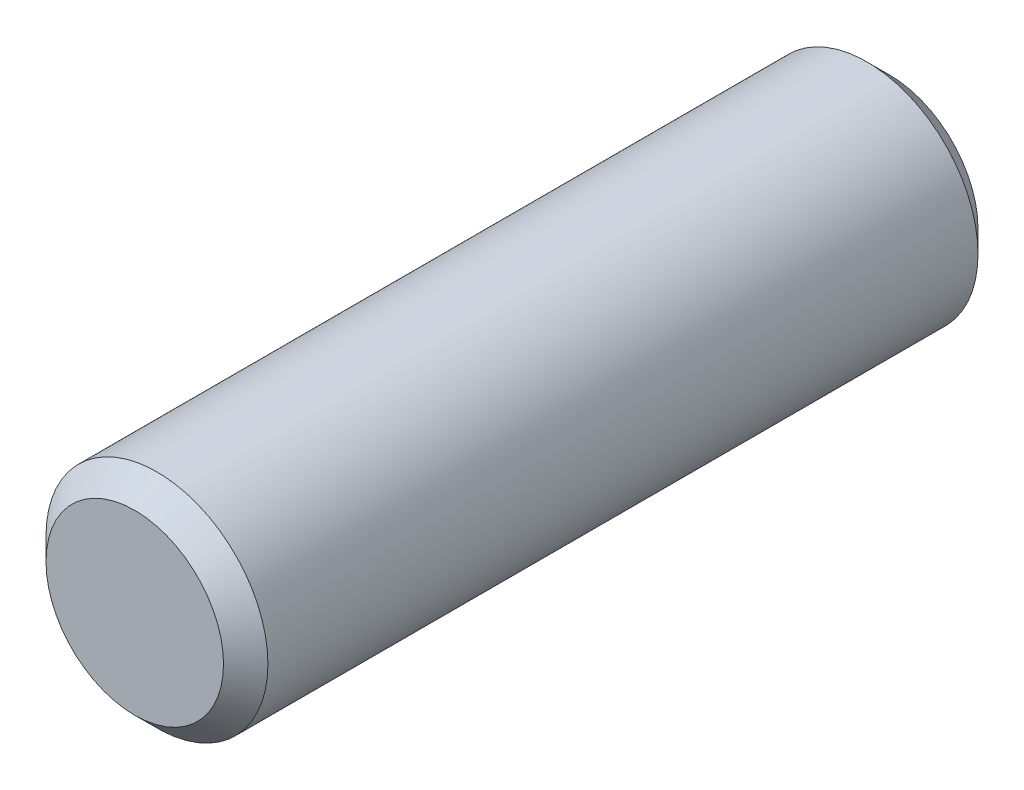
ISO-10303-21;
HEADER;
FILE_DESCRIPTION(('STEP AP214'),'2;1');
FILE_NAME('part.step','',(''),(''),'','','');
FILE_SCHEMA(('AUTOMOTIVE_DESIGN { 1 0 10303 214 1 1 1 1 }'));
ENDSEC;
DATA;
#1=APPLICATION_CONTEXT('core data for automotive mechanical design processes');
#2=APPLICATION_PROTOCOL_DEFINITION('international standard','automotive_design',2000,#1);
#3=PRODUCT_CONTEXT('',#1,'mechanical');
#4=PRODUCT('Part','Part','',(#3));
#5=PRODUCT_RELATED_PRODUCT_CATEGORY('part','',(#4));
#6=PRODUCT_DEFINITION_FORMATION('','',#4);
#7=PRODUCT_DEFINITION_CONTEXT('part definition',#1,'design');
#8=PRODUCT_DEFINITION('design','',#6,#7);
#9=PRODUCT_DEFINITION_SHAPE('','',#8);
#10=(LENGTH_UNIT() NAMED_UNIT(*) SI_UNIT(.MILLI.,.METRE.));
#11=(NAMED_UNIT(*) PLANE_ANGLE_UNIT() SI_UNIT($,.RADIAN.));
#12=(NAMED_UNIT(*) SI_UNIT($,.STERADIAN.) SOLID_ANGLE_UNIT());
#13=UNCERTAINTY_MEASURE_WITH_UNIT(LENGTH_MEASURE(1.E-05),#10,'distance_accuracy_value','');
#14=(GEOMETRIC_REPRESENTATION_CONTEXT(3) GLOBAL_UNCERTAINTY_ASSIGNED_CONTEXT((#13)) GLOBAL_UNIT_ASSIGNED_CONTEXT((#10,
#11,#12)) REPRESENTATION_CONTEXT('',''));
#15=CARTESIAN_POINT('',(0.,0.,0.));
#16=DIRECTION('',(0.,0.,1.));
#17=DIRECTION('',(1.,0.,0.));
#18=AXIS2_PLACEMENT_3D('',#15,#16,#17);
#19=CARTESIAN_POINT('',(0.,0.,8.49999999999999));
#20=DIRECTION('',(0.,0.,-1.));
#21=DIRECTION('',(-1.,0.,0.));
#22=AXIS2_PLACEMENT_3D('',#19,#20,#21);
#23=CYLINDRICAL_SURFACE('',#22,2.5);
#24=CARTESIAN_POINT('',(0.,0.,7.99999999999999));
#25=DIRECTION('',(0.,0.,1.));
#26=DIRECTION('',(1.,0.,0.));
#27=AXIS2_PLACEMENT_3D('',#24,#25,#26);
#28=CIRCLE('',#27,2.5);
#29=CARTESIAN_POINT('',(2.5,0.,7.99999999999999));
#30=VERTEX_POINT('',#29);
#31=EDGE_CURVE('E31',#30,#30,#28,.F.);
#32=ORIENTED_EDGE('',*,*,#31,.T.);
#33=EDGE_LOOP('',(#32));
#34=FACE_BOUND('',#33,.T.);
#35=CARTESIAN_POINT('',(0.,0.,-7.99999999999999));
#36=DIRECTION('',(0.,0.,1.));
#37=DIRECTION('',(1.,0.,0.));
#38=AXIS2_PLACEMENT_3D('',#35,#36,#37);
#39=CIRCLE('',#38,2.5);
#40=CARTESIAN_POINT('',(2.5,0.,-7.99999999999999));
#41=VERTEX_POINT('',#40);
#42=EDGE_CURVE('E35',#41,#41,#39,.T.);
#43=ORIENTED_EDGE('',*,*,#42,.T.);
#44=EDGE_LOOP('',(#43));
#45=FACE_BOUND('',#44,.T.);
#46=ADVANCED_FACE('F25',(#34,#45),#23,.T.);
#47=CARTESIAN_POINT('',(0.,0.,8.49999999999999));
#48=DIRECTION('',(0.,0.,1.));
#49=DIRECTION('',(1.,0.,0.));
#50=AXIS2_PLACEMENT_3D('',#47,#48,#49);
#51=PLANE('',#50);
#52=CARTESIAN_POINT('',(0.,0.,8.49999999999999));
#53=DIRECTION('',(0.,0.,1.));
#54=DIRECTION('',(1.,0.,0.));
#55=AXIS2_PLACEMENT_3D('',#52,#53,#54);
#56=CIRCLE('',#55,2.);
#57=CARTESIAN_POINT('',(2.,0.,8.49999999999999));
#58=VERTEX_POINT('',#57);
#59=EDGE_CURVE('E39',#58,#58,#56,.T.);
#60=ORIENTED_EDGE('',*,*,#59,.T.);
#61=EDGE_LOOP('',(#60));
#62=FACE_BOUND('',#61,.T.);
#63=ADVANCED_FACE('F45',(#62),#51,.T.);
#64=CARTESIAN_POINT('',(0.,0.,-8.49999999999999));
#65=DIRECTION('',(0.,0.,1.));
#66=DIRECTION('',(1.,0.,0.));
#67=AXIS2_PLACEMENT_3D('',#64,#65,#66);
#68=PLANE('',#67);
#69=CARTESIAN_POINT('',(0.,0.,-8.49999999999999));
#70=DIRECTION('',(0.,0.,1.));
#71=DIRECTION('',(1.,0.,0.));
#72=AXIS2_PLACEMENT_3D('',#69,#70,#71);
#73=CIRCLE('',#72,2.);
#74=CARTESIAN_POINT('',(2.,0.,-8.49999999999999));
#75=VERTEX_POINT('',#74);
#76=EDGE_CURVE('E10',#75,#75,#73,.F.);
#77=ORIENTED_EDGE('',*,*,#76,.T.);
#78=EDGE_LOOP('',(#77));
#79=FACE_BOUND('',#78,.T.);
#80=ADVANCED_FACE('F50',(#79),#68,.F.);
#81=CARTESIAN_POINT('',(0.,0.,8.49999999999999));
#82=DIRECTION('',(0.,0.,-1.));
#83=DIRECTION('',(-1.,0.,0.));
#84=AXIS2_PLACEMENT_3D('',#81,#82,#83);
#85=CONICAL_SURFACE('',#84,2.,0.785398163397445);
#86=ORIENTED_EDGE('',*,*,#31,.F.);
#87=EDGE_LOOP('',(#86));
#88=FACE_BOUND('',#87,.T.);
#89=ORIENTED_EDGE('',*,*,#59,.F.);
#90=EDGE_LOOP('',(#89));
#91=FACE_BOUND('',#90,.T.);
#92=ADVANCED_FACE('F47',(#88,#91),#85,.T.);
#93=CARTESIAN_POINT('',(0.,0.,-7.99999999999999));
#94=DIRECTION('',(0.,0.,1.));
#95=DIRECTION('',(1.,0.,0.));
#96=AXIS2_PLACEMENT_3D('',#93,#94,#95);
#97=CONICAL_SURFACE('',#96,2.5,0.785398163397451);
#98=ORIENTED_EDGE('',*,*,#76,.F.);
#99=EDGE_LOOP('',(#98));
#100=FACE_BOUND('',#99,.T.);
#101=ORIENTED_EDGE('',*,*,#42,.F.);
#102=EDGE_LOOP('',(#101));
#103=FACE_BOUND('',#102,.T.);
#104=ADVANCED_FACE('F49',(#100,#103),#97,.T.);
#105=CLOSED_SHELL('',(#46,#63,#80,#92,#104));
#106=MANIFOLD_SOLID_BREP('B2',#105);
#107=ADVANCED_BREP_SHAPE_REPRESENTATION('',(#18,#106),#14);
#108=SHAPE_DEFINITION_REPRESENTATION(#9,#107);
ENDSEC;
END-ISO-10303-21;
